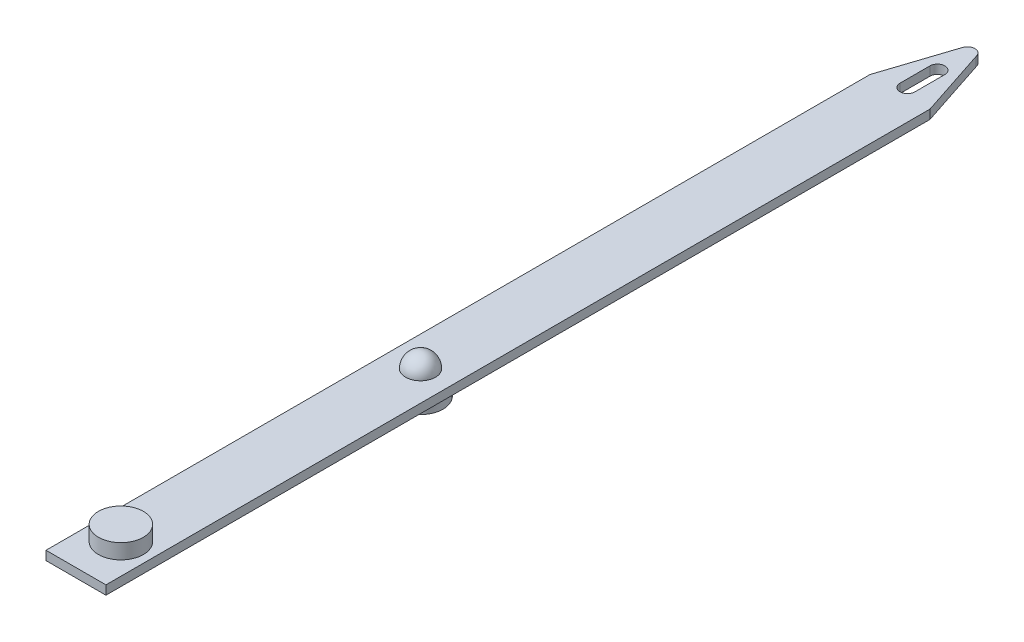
ISO-10303-21;
HEADER;
FILE_DESCRIPTION(('STEP AP214'),'2;1');
FILE_NAME('part.step','',(''),(''),'','','');
FILE_SCHEMA(('AUTOMOTIVE_DESIGN { 1 0 10303 214 1 1 1 1 }'));
ENDSEC;
DATA;
#1=APPLICATION_CONTEXT('core data for automotive mechanical design processes');
#2=APPLICATION_PROTOCOL_DEFINITION('international standard','automotive_design',2000,#1);
#3=PRODUCT_CONTEXT('',#1,'mechanical');
#4=PRODUCT('Part','Part','',(#3));
#5=PRODUCT_RELATED_PRODUCT_CATEGORY('part','',(#4));
#6=PRODUCT_DEFINITION_FORMATION('','',#4);
#7=PRODUCT_DEFINITION_CONTEXT('part definition',#1,'design');
#8=PRODUCT_DEFINITION('design','',#6,#7);
#9=PRODUCT_DEFINITION_SHAPE('','',#8);
#10=(LENGTH_UNIT() NAMED_UNIT(*) SI_UNIT(.MILLI.,.METRE.));
#11=(NAMED_UNIT(*) PLANE_ANGLE_UNIT() SI_UNIT($,.RADIAN.));
#12=(NAMED_UNIT(*) SI_UNIT($,.STERADIAN.) SOLID_ANGLE_UNIT());
#13=UNCERTAINTY_MEASURE_WITH_UNIT(LENGTH_MEASURE(1.E-05),#10,'distance_accuracy_value','');
#14=(GEOMETRIC_REPRESENTATION_CONTEXT(3) GLOBAL_UNCERTAINTY_ASSIGNED_CONTEXT((#13)) GLOBAL_UNIT_ASSIGNED_CONTEXT((#10,
#11,#12)) REPRESENTATION_CONTEXT('',''));
#15=CARTESIAN_POINT('',(0.,0.,0.));
#16=DIRECTION('',(0.,0.,1.));
#17=DIRECTION('',(1.,0.,0.));
#18=AXIS2_PLACEMENT_3D('',#15,#16,#17);
#19=CARTESIAN_POINT('',(0.,0.,-20.));
#20=DIRECTION('',(0.,-1.,0.));
#21=DIRECTION('',(0.,0.,-1.));
#22=AXIS2_PLACEMENT_3D('',#19,#20,#21);
#23=PLANE('',#22);
#24=CARTESIAN_POINT('',(2.,0.,37.));
#25=DIRECTION('',(0.,-1.,0.));
#26=DIRECTION('',(0.,0.,-1.));
#27=AXIS2_PLACEMENT_3D('',#24,#25,#26);
#28=CIRCLE('',#27,1.);
#29=CARTESIAN_POINT('',(2.,0.,36.));
#30=VERTEX_POINT('',#29);
#31=EDGE_CURVE('E449',#30,#30,#28,.T.);
#32=ORIENTED_EDGE('',*,*,#31,.F.);
#33=EDGE_LOOP('',(#32));
#34=FACE_BOUND('',#33,.T.);
#35=CARTESIAN_POINT('',(2.,0.,-17.5));
#36=DIRECTION('',(0.,1.,0.));
#37=DIRECTION('',(0.,0.,1.));
#38=AXIS2_PLACEMENT_3D('',#35,#36,#37);
#39=CIRCLE('',#38,0.5);
#40=CARTESIAN_POINT('',(2.5,0.,-17.5));
#41=VERTEX_POINT('',#40);
#42=CARTESIAN_POINT('',(1.5,0.,-17.5));
#43=VERTEX_POINT('',#42);
#44=EDGE_CURVE('E216',#41,#43,#39,.T.);
#45=ORIENTED_EDGE('',*,*,#44,.T.);
#46=DIRECTION('',(0.,0.,-1.));
#47=VECTOR('',#46,1.);
#48=CARTESIAN_POINT('',(1.5,0.,0.));
#49=LINE('',#48,#47);
#50=CARTESIAN_POINT('',(1.5,0.,-15.5));
#51=VERTEX_POINT('',#50);
#52=EDGE_CURVE('E219',#51,#43,#49,.T.);
#53=ORIENTED_EDGE('',*,*,#52,.F.);
#54=CARTESIAN_POINT('',(2.,0.,-15.5));
#55=DIRECTION('',(0.,1.,0.));
#56=DIRECTION('',(0.,0.,1.));
#57=AXIS2_PLACEMENT_3D('',#54,#55,#56);
#58=CIRCLE('',#57,0.5);
#59=CARTESIAN_POINT('',(2.5,0.,-15.5));
#60=VERTEX_POINT('',#59);
#61=EDGE_CURVE('E128',#51,#60,#58,.T.);
#62=ORIENTED_EDGE('',*,*,#61,.T.);
#63=DIRECTION('',(0.,0.,-1.));
#64=VECTOR('',#63,1.);
#65=CARTESIAN_POINT('',(2.5,0.,0.));
#66=LINE('',#65,#64);
#67=EDGE_CURVE('E223',#60,#41,#66,.T.);
#68=ORIENTED_EDGE('',*,*,#67,.T.);
#69=EDGE_LOOP('',(#45,#53,#62,#68));
#70=FACE_BOUND('',#69,.T.);
#71=DIRECTION('',(0.311256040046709,0.,-0.950326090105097));
#72=VECTOR('',#71,1.);
#73=CARTESIAN_POINT('',(-7.28610313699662,0.,7.24591016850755));
#74=LINE('',#73,#72);
#75=CARTESIAN_POINT('',(0.,0.,-15.));
#76=VERTEX_POINT('',#75);
#77=CARTESIAN_POINT('',(1.52483695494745,0.,-19.6556280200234));
#78=VERTEX_POINT('',#77);
#79=EDGE_CURVE('E238',#76,#78,#74,.T.);
#80=ORIENTED_EDGE('',*,*,#79,.T.);
#81=CARTESIAN_POINT('',(2.,0.,-19.5));
#82=DIRECTION('',(0.,1.,0.));
#83=DIRECTION('',(0.,0.,1.));
#84=AXIS2_PLACEMENT_3D('',#81,#82,#83);
#85=CIRCLE('',#84,0.5);
#86=CARTESIAN_POINT('',(2.4903123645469,0.,-19.5979478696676));
#87=VERTEX_POINT('',#86);
#88=EDGE_CURVE('E253',#87,#78,#85,.T.);
#89=ORIENTED_EDGE('',*,*,#88,.F.);
#90=DIRECTION('',(-0.311954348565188,0.,-0.95009709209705));
#91=VECTOR('',#90,1.);
#92=CARTESIAN_POINT('',(5.1945609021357,0.,-11.3618111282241));
#93=LINE('',#92,#91);
#94=CARTESIAN_POINT('',(4.,0.,-15.));
#95=VERTEX_POINT('',#94);
#96=EDGE_CURVE('E255',#95,#87,#93,.T.);
#97=ORIENTED_EDGE('',*,*,#96,.F.);
#98=DIRECTION('',(0.,0.,1.));
#99=VECTOR('',#98,1.);
#100=CARTESIAN_POINT('',(4.,0.,-20.));
#101=LINE('',#100,#99);
#102=CARTESIAN_POINT('',(4.,0.,40.));
#103=VERTEX_POINT('',#102);
#104=EDGE_CURVE('E191',#95,#103,#101,.T.);
#105=ORIENTED_EDGE('',*,*,#104,.T.);
#106=DIRECTION('',(1.,0.,0.));
#107=VECTOR('',#106,1.);
#108=CARTESIAN_POINT('',(0.,0.,40.));
#109=LINE('',#108,#107);
#110=CARTESIAN_POINT('',(0.,0.,40.));
#111=VERTEX_POINT('',#110);
#112=EDGE_CURVE('E194',#111,#103,#109,.T.);
#113=ORIENTED_EDGE('',*,*,#112,.F.);
#114=DIRECTION('',(0.,0.,1.));
#115=VECTOR('',#114,1.);
#116=CARTESIAN_POINT('',(0.,0.,-20.));
#117=LINE('',#116,#115);
#118=EDGE_CURVE('E107',#76,#111,#117,.T.);
#119=ORIENTED_EDGE('',*,*,#118,.F.);
#120=EDGE_LOOP('',(#80,#89,#97,#105,#113,#119));
#121=FACE_BOUND('',#120,.T.);
#122=CARTESIAN_POINT('',(2.,0.,17.));
#123=DIRECTION('',(0.,-1.,0.));
#124=DIRECTION('',(0.,0.,-1.));
#125=AXIS2_PLACEMENT_3D('',#122,#123,#124);
#126=CIRCLE('',#125,1.5);
#127=CARTESIAN_POINT('',(2.,0.,15.5));
#128=VERTEX_POINT('',#127);
#129=EDGE_CURVE('E447',#128,#128,#126,.T.);
#130=ORIENTED_EDGE('',*,*,#129,.F.);
#131=EDGE_LOOP('',(#130));
#132=FACE_BOUND('',#131,.T.);
#133=ADVANCED_FACE('F103',(#34,#70,#121,#132),#23,.T.);
#134=CARTESIAN_POINT('',(0.,0.6,-20.));
#135=DIRECTION('',(0.,1.,0.));
#136=DIRECTION('',(0.,0.,1.));
#137=AXIS2_PLACEMENT_3D('',#134,#135,#136);
#138=PLANE('',#137);
#139=CARTESIAN_POINT('',(2.,0.6,17.));
#140=DIRECTION('',(0.,1.,0.));
#141=DIRECTION('',(0.,0.,1.));
#142=AXIS2_PLACEMENT_3D('',#139,#140,#141);
#143=CIRCLE('',#142,1.);
#144=CARTESIAN_POINT('',(2.,0.6,18.));
#145=VERTEX_POINT('',#144);
#146=EDGE_CURVE('E207',#145,#145,#143,.T.);
#147=ORIENTED_EDGE('',*,*,#146,.F.);
#148=EDGE_LOOP('',(#147));
#149=FACE_BOUND('',#148,.T.);
#150=CARTESIAN_POINT('',(2.,0.6,-17.5));
#151=DIRECTION('',(0.,1.,0.));
#152=DIRECTION('',(0.,0.,1.));
#153=AXIS2_PLACEMENT_3D('',#150,#151,#152);
#154=CIRCLE('',#153,0.5);
#155=CARTESIAN_POINT('',(2.5,0.6,-17.5));
#156=VERTEX_POINT('',#155);
#157=CARTESIAN_POINT('',(1.5,0.6,-17.5));
#158=VERTEX_POINT('',#157);
#159=EDGE_CURVE('E120',#156,#158,#154,.T.);
#160=ORIENTED_EDGE('',*,*,#159,.F.);
#161=DIRECTION('',(0.,0.,-1.));
#162=VECTOR('',#161,1.);
#163=CARTESIAN_POINT('',(2.5,0.6,0.));
#164=LINE('',#163,#162);
#165=CARTESIAN_POINT('',(2.5,0.6,-15.5));
#166=VERTEX_POINT('',#165);
#167=EDGE_CURVE('E220',#166,#156,#164,.T.);
#168=ORIENTED_EDGE('',*,*,#167,.F.);
#169=CARTESIAN_POINT('',(2.,0.6,-15.5));
#170=DIRECTION('',(0.,1.,0.));
#171=DIRECTION('',(0.,0.,1.));
#172=AXIS2_PLACEMENT_3D('',#169,#170,#171);
#173=CIRCLE('',#172,0.5);
#174=CARTESIAN_POINT('',(1.5,0.6,-15.5));
#175=VERTEX_POINT('',#174);
#176=EDGE_CURVE('E231',#175,#166,#173,.T.);
#177=ORIENTED_EDGE('',*,*,#176,.F.);
#178=DIRECTION('',(0.,0.,-1.));
#179=VECTOR('',#178,1.);
#180=CARTESIAN_POINT('',(1.5,0.6,0.));
#181=LINE('',#180,#179);
#182=EDGE_CURVE('E228',#175,#158,#181,.T.);
#183=ORIENTED_EDGE('',*,*,#182,.T.);
#184=EDGE_LOOP('',(#160,#168,#177,#183));
#185=FACE_BOUND('',#184,.T.);
#186=CARTESIAN_POINT('',(2.,0.6,-19.5));
#187=DIRECTION('',(0.,1.,0.));
#188=DIRECTION('',(0.,0.,1.));
#189=AXIS2_PLACEMENT_3D('',#186,#187,#188);
#190=CIRCLE('',#189,0.5);
#191=CARTESIAN_POINT('',(2.4903123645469,0.6,-19.5979478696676));
#192=VERTEX_POINT('',#191);
#193=CARTESIAN_POINT('',(1.52483695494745,0.6,-19.6556280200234));
#194=VERTEX_POINT('',#193);
#195=EDGE_CURVE('E251',#192,#194,#190,.T.);
#196=ORIENTED_EDGE('',*,*,#195,.T.);
#197=DIRECTION('',(0.311256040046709,0.,-0.950326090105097));
#198=VECTOR('',#197,1.);
#199=CARTESIAN_POINT('',(-7.28610313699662,0.6,7.24591016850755));
#200=LINE('',#199,#198);
#201=CARTESIAN_POINT('',(0.,0.6,-15.));
#202=VERTEX_POINT('',#201);
#203=EDGE_CURVE('E245',#202,#194,#200,.T.);
#204=ORIENTED_EDGE('',*,*,#203,.F.);
#205=DIRECTION('',(0.,0.,1.));
#206=VECTOR('',#205,1.);
#207=CARTESIAN_POINT('',(0.,0.6,-20.));
#208=LINE('',#207,#206);
#209=CARTESIAN_POINT('',(0.,0.6,40.));
#210=VERTEX_POINT('',#209);
#211=EDGE_CURVE('E12',#202,#210,#208,.T.);
#212=ORIENTED_EDGE('',*,*,#211,.T.);
#213=DIRECTION('',(-1.,0.,0.));
#214=VECTOR('',#213,1.);
#215=CARTESIAN_POINT('',(0.,0.6,40.));
#216=LINE('',#215,#214);
#217=CARTESIAN_POINT('',(4.,0.6,40.));
#218=VERTEX_POINT('',#217);
#219=EDGE_CURVE('E206',#218,#210,#216,.T.);
#220=ORIENTED_EDGE('',*,*,#219,.F.);
#221=DIRECTION('',(0.,0.,1.));
#222=VECTOR('',#221,1.);
#223=CARTESIAN_POINT('',(4.,0.6,-20.));
#224=LINE('',#223,#222);
#225=CARTESIAN_POINT('',(4.,0.6,-15.));
#226=VERTEX_POINT('',#225);
#227=EDGE_CURVE('E112',#226,#218,#224,.T.);
#228=ORIENTED_EDGE('',*,*,#227,.F.);
#229=DIRECTION('',(-0.311954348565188,0.,-0.95009709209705));
#230=VECTOR('',#229,1.);
#231=CARTESIAN_POINT('',(5.1945609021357,0.6,-11.3618111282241));
#232=LINE('',#231,#230);
#233=EDGE_CURVE('E256',#226,#192,#232,.T.);
#234=ORIENTED_EDGE('',*,*,#233,.T.);
#235=EDGE_LOOP('',(#196,#204,#212,#220,#228,#234));
#236=FACE_BOUND('',#235,.T.);
#237=CARTESIAN_POINT('',(2.,0.6,37.));
#238=DIRECTION('',(0.,1.,0.));
#239=DIRECTION('',(0.,0.,1.));
#240=AXIS2_PLACEMENT_3D('',#237,#238,#239);
#241=CIRCLE('',#240,1.5);
#242=CARTESIAN_POINT('',(2.,0.6,38.5));
#243=VERTEX_POINT('',#242);
#244=EDGE_CURVE('E454',#243,#243,#241,.T.);
#245=ORIENTED_EDGE('',*,*,#244,.F.);
#246=EDGE_LOOP('',(#245));
#247=FACE_BOUND('',#246,.T.);
#248=ADVANCED_FACE('F269',(#149,#185,#236,#247),#138,.T.);
#249=CARTESIAN_POINT('',(4.,0.,-20.));
#250=DIRECTION('',(1.,0.,0.));
#251=DIRECTION('',(0.,0.,-1.));
#252=AXIS2_PLACEMENT_3D('',#249,#250,#251);
#253=PLANE('',#252);
#254=ORIENTED_EDGE('',*,*,#104,.F.);
#255=DIRECTION('',(0.,1.,0.));
#256=VECTOR('',#255,1.);
#257=CARTESIAN_POINT('',(4.,0.,-15.));
#258=LINE('',#257,#256);
#259=EDGE_CURVE('E192',#95,#226,#258,.T.);
#260=ORIENTED_EDGE('',*,*,#259,.T.);
#261=ORIENTED_EDGE('',*,*,#227,.T.);
#262=DIRECTION('',(0.,1.,0.));
#263=VECTOR('',#262,1.);
#264=CARTESIAN_POINT('',(4.,0.6,40.));
#265=LINE('',#264,#263);
#266=EDGE_CURVE('E201',#103,#218,#265,.T.);
#267=ORIENTED_EDGE('',*,*,#266,.F.);
#268=EDGE_LOOP('',(#254,#260,#261,#267));
#269=FACE_BOUND('',#268,.T.);
#270=ADVANCED_FACE('F267',(#269),#253,.T.);
#271=CARTESIAN_POINT('',(0.,0.,-20.));
#272=DIRECTION('',(-1.,0.,0.));
#273=DIRECTION('',(0.,0.,1.));
#274=AXIS2_PLACEMENT_3D('',#271,#272,#273);
#275=PLANE('',#274);
#276=DIRECTION('',(0.,1.,0.));
#277=VECTOR('',#276,1.);
#278=CARTESIAN_POINT('',(0.,0.,-15.));
#279=LINE('',#278,#277);
#280=EDGE_CURVE('E188',#76,#202,#279,.T.);
#281=ORIENTED_EDGE('',*,*,#280,.F.);
#282=ORIENTED_EDGE('',*,*,#118,.T.);
#283=DIRECTION('',(0.,-1.,0.));
#284=VECTOR('',#283,1.);
#285=CARTESIAN_POINT('',(0.,0.6,40.));
#286=LINE('',#285,#284);
#287=EDGE_CURVE('E187',#210,#111,#286,.T.);
#288=ORIENTED_EDGE('',*,*,#287,.F.);
#289=ORIENTED_EDGE('',*,*,#211,.F.);
#290=EDGE_LOOP('',(#281,#282,#288,#289));
#291=FACE_BOUND('',#290,.T.);
#292=ADVANCED_FACE('F184',(#291),#275,.T.);
#293=CARTESIAN_POINT('',(2.,0.,-19.5));
#294=DIRECTION('',(0.,1.,0.));
#295=DIRECTION('',(0.,0.,1.));
#296=AXIS2_PLACEMENT_3D('',#293,#294,#295);
#297=CYLINDRICAL_SURFACE('',#296,0.5);
#298=ORIENTED_EDGE('',*,*,#195,.F.);
#299=DIRECTION('',(0.,1.,0.));
#300=VECTOR('',#299,1.);
#301=CARTESIAN_POINT('',(2.4903123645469,0.,-19.5979478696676));
#302=LINE('',#301,#300);
#303=EDGE_CURVE('E258',#87,#192,#302,.T.);
#304=ORIENTED_EDGE('',*,*,#303,.F.);
#305=ORIENTED_EDGE('',*,*,#88,.T.);
#306=DIRECTION('',(0.,1.,0.));
#307=VECTOR('',#306,1.);
#308=CARTESIAN_POINT('',(1.52483695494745,0.,-19.6556280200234));
#309=LINE('',#308,#307);
#310=EDGE_CURVE('E246',#78,#194,#309,.T.);
#311=ORIENTED_EDGE('',*,*,#310,.T.);
#312=EDGE_LOOP('',(#298,#304,#305,#311));
#313=FACE_BOUND('',#312,.T.);
#314=ADVANCED_FACE('F279',(#313),#297,.T.);
#315=CARTESIAN_POINT('',(5.1945609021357,0.,-11.3618111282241));
#316=DIRECTION('',(0.95009709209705,0.,-0.311954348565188));
#317=DIRECTION('',(-0.311954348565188,0.,-0.95009709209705));
#318=AXIS2_PLACEMENT_3D('',#315,#316,#317);
#319=PLANE('',#318);
#320=ORIENTED_EDGE('',*,*,#233,.F.);
#321=ORIENTED_EDGE('',*,*,#259,.F.);
#322=ORIENTED_EDGE('',*,*,#96,.T.);
#323=ORIENTED_EDGE('',*,*,#303,.T.);
#324=EDGE_LOOP('',(#320,#321,#322,#323));
#325=FACE_BOUND('',#324,.T.);
#326=ADVANCED_FACE('F281',(#325),#319,.T.);
#327=CARTESIAN_POINT('',(-7.28610313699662,0.,7.24591016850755));
#328=DIRECTION('',(0.950326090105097,0.,0.311256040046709));
#329=DIRECTION('',(0.311256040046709,0.,-0.950326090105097));
#330=AXIS2_PLACEMENT_3D('',#327,#328,#329);
#331=PLANE('',#330);
#332=ORIENTED_EDGE('',*,*,#203,.T.);
#333=ORIENTED_EDGE('',*,*,#310,.F.);
#334=ORIENTED_EDGE('',*,*,#79,.F.);
#335=ORIENTED_EDGE('',*,*,#280,.T.);
#336=EDGE_LOOP('',(#332,#333,#334,#335));
#337=FACE_BOUND('',#336,.T.);
#338=ADVANCED_FACE('F275',(#337),#331,.F.);
#339=CARTESIAN_POINT('',(2.,0.,-17.5));
#340=DIRECTION('',(0.,1.,0.));
#341=DIRECTION('',(0.,0.,1.));
#342=AXIS2_PLACEMENT_3D('',#339,#340,#341);
#343=CYLINDRICAL_SURFACE('',#342,0.5);
#344=ORIENTED_EDGE('',*,*,#159,.T.);
#345=DIRECTION('',(0.,1.,0.));
#346=VECTOR('',#345,1.);
#347=CARTESIAN_POINT('',(1.5,0.,-17.5));
#348=LINE('',#347,#346);
#349=EDGE_CURVE('E226',#43,#158,#348,.T.);
#350=ORIENTED_EDGE('',*,*,#349,.F.);
#351=ORIENTED_EDGE('',*,*,#44,.F.);
#352=DIRECTION('',(0.,1.,0.));
#353=VECTOR('',#352,1.);
#354=CARTESIAN_POINT('',(2.5,0.,-17.5));
#355=LINE('',#354,#353);
#356=EDGE_CURVE('E236',#41,#156,#355,.T.);
#357=ORIENTED_EDGE('',*,*,#356,.T.);
#358=EDGE_LOOP('',(#344,#350,#351,#357));
#359=FACE_BOUND('',#358,.T.);
#360=ADVANCED_FACE('F288',(#359),#343,.F.);
#361=CARTESIAN_POINT('',(2.5,0.,0.));
#362=DIRECTION('',(1.,0.,0.));
#363=DIRECTION('',(0.,0.,-1.));
#364=AXIS2_PLACEMENT_3D('',#361,#362,#363);
#365=PLANE('',#364);
#366=ORIENTED_EDGE('',*,*,#167,.T.);
#367=ORIENTED_EDGE('',*,*,#356,.F.);
#368=ORIENTED_EDGE('',*,*,#67,.F.);
#369=DIRECTION('',(0.,1.,0.));
#370=VECTOR('',#369,1.);
#371=CARTESIAN_POINT('',(2.5,0.,-15.5));
#372=LINE('',#371,#370);
#373=EDGE_CURVE('E239',#60,#166,#372,.T.);
#374=ORIENTED_EDGE('',*,*,#373,.T.);
#375=EDGE_LOOP('',(#366,#367,#368,#374));
#376=FACE_BOUND('',#375,.T.);
#377=ADVANCED_FACE('F327',(#376),#365,.F.);
#378=CARTESIAN_POINT('',(2.,0.,-15.5));
#379=DIRECTION('',(0.,1.,0.));
#380=DIRECTION('',(0.,0.,1.));
#381=AXIS2_PLACEMENT_3D('',#378,#379,#380);
#382=CYLINDRICAL_SURFACE('',#381,0.5);
#383=ORIENTED_EDGE('',*,*,#176,.T.);
#384=ORIENTED_EDGE('',*,*,#373,.F.);
#385=ORIENTED_EDGE('',*,*,#61,.F.);
#386=DIRECTION('',(0.,1.,0.));
#387=VECTOR('',#386,1.);
#388=CARTESIAN_POINT('',(1.5,0.,-15.5));
#389=LINE('',#388,#387);
#390=EDGE_CURVE('E241',#51,#175,#389,.T.);
#391=ORIENTED_EDGE('',*,*,#390,.T.);
#392=EDGE_LOOP('',(#383,#384,#385,#391));
#393=FACE_BOUND('',#392,.T.);
#394=ADVANCED_FACE('F328',(#393),#382,.F.);
#395=CARTESIAN_POINT('',(1.5,0.,0.));
#396=DIRECTION('',(1.,0.,0.));
#397=DIRECTION('',(0.,0.,-1.));
#398=AXIS2_PLACEMENT_3D('',#395,#396,#397);
#399=PLANE('',#398);
#400=ORIENTED_EDGE('',*,*,#182,.F.);
#401=ORIENTED_EDGE('',*,*,#390,.F.);
#402=ORIENTED_EDGE('',*,*,#52,.T.);
#403=ORIENTED_EDGE('',*,*,#349,.T.);
#404=EDGE_LOOP('',(#400,#401,#402,#403));
#405=FACE_BOUND('',#404,.T.);
#406=ADVANCED_FACE('F322',(#405),#399,.T.);
#407=CARTESIAN_POINT('',(0.,0.,40.));
#408=DIRECTION('',(0.,0.,1.));
#409=DIRECTION('',(1.,0.,0.));
#410=AXIS2_PLACEMENT_3D('',#407,#408,#409);
#411=PLANE('',#410);
#412=ORIENTED_EDGE('',*,*,#287,.T.);
#413=ORIENTED_EDGE('',*,*,#112,.T.);
#414=ORIENTED_EDGE('',*,*,#266,.T.);
#415=ORIENTED_EDGE('',*,*,#219,.T.);
#416=EDGE_LOOP('',(#412,#413,#414,#415));
#417=FACE_BOUND('',#416,.T.);
#418=ADVANCED_FACE('F204',(#417),#411,.T.);
#419=CARTESIAN_POINT('',(2.,1.6,37.));
#420=DIRECTION('',(0.,-1.,0.));
#421=DIRECTION('',(0.,0.,-1.));
#422=AXIS2_PLACEMENT_3D('',#419,#420,#421);
#423=CYLINDRICAL_SURFACE('',#422,1.5);
#424=CARTESIAN_POINT('',(2.,1.6,37.));
#425=DIRECTION('',(0.,1.,0.));
#426=DIRECTION('',(0.,0.,1.));
#427=AXIS2_PLACEMENT_3D('',#424,#425,#426);
#428=CIRCLE('',#427,1.5);
#429=CARTESIAN_POINT('',(2.,1.6,38.5));
#430=VERTEX_POINT('',#429);
#431=EDGE_CURVE('E210',#430,#430,#428,.T.);
#432=ORIENTED_EDGE('',*,*,#431,.F.);
#433=EDGE_LOOP('',(#432));
#434=FACE_BOUND('',#433,.T.);
#435=ORIENTED_EDGE('',*,*,#244,.T.);
#436=EDGE_LOOP('',(#435));
#437=FACE_BOUND('',#436,.T.);
#438=ADVANCED_FACE('F382',(#434,#437),#423,.T.);
#439=CARTESIAN_POINT('',(2.,1.6,37.));
#440=DIRECTION('',(0.,1.,0.));
#441=DIRECTION('',(0.,0.,1.));
#442=AXIS2_PLACEMENT_3D('',#439,#440,#441);
#443=PLANE('',#442);
#444=ORIENTED_EDGE('',*,*,#431,.T.);
#445=EDGE_LOOP('',(#444));
#446=FACE_BOUND('',#445,.T.);
#447=ADVANCED_FACE('F397',(#446),#443,.T.);
#448=CARTESIAN_POINT('',(2.,-1.,17.));
#449=DIRECTION('',(0.,1.,0.));
#450=DIRECTION('',(0.,0.,1.));
#451=AXIS2_PLACEMENT_3D('',#448,#449,#450);
#452=CYLINDRICAL_SURFACE('',#451,1.5);
#453=CARTESIAN_POINT('',(2.,-1.,17.));
#454=DIRECTION('',(0.,-1.,0.));
#455=DIRECTION('',(0.,0.,-1.));
#456=AXIS2_PLACEMENT_3D('',#453,#454,#455);
#457=CIRCLE('',#456,1.5);
#458=CARTESIAN_POINT('',(2.,-1.,15.5));
#459=VERTEX_POINT('',#458);
#460=EDGE_CURVE('E444',#459,#459,#457,.T.);
#461=ORIENTED_EDGE('',*,*,#460,.F.);
#462=EDGE_LOOP('',(#461));
#463=FACE_BOUND('',#462,.T.);
#464=ORIENTED_EDGE('',*,*,#129,.T.);
#465=EDGE_LOOP('',(#464));
#466=FACE_BOUND('',#465,.T.);
#467=ADVANCED_FACE('F313',(#463,#466),#452,.T.);
#468=CARTESIAN_POINT('',(2.,-1.,17.));
#469=DIRECTION('',(0.,-1.,0.));
#470=DIRECTION('',(0.,0.,-1.));
#471=AXIS2_PLACEMENT_3D('',#468,#469,#470);
#472=PLANE('',#471);
#473=ORIENTED_EDGE('',*,*,#460,.T.);
#474=EDGE_LOOP('',(#473));
#475=FACE_BOUND('',#474,.T.);
#476=ADVANCED_FACE('F306',(#475),#472,.T.);
#477=CARTESIAN_POINT('',(2.,0.6,17.));
#478=DIRECTION('',(0.,0.,1.));
#479=DIRECTION('',(1.,0.,0.));
#480=AXIS2_PLACEMENT_3D('',#477,#478,#479);
#481=SPHERICAL_SURFACE('',#480,1.);
#482=CARTESIAN_POINT('',(2.,0.6,17.));
#483=DIRECTION('',(0.,1.,0.));
#484=DIRECTION('',(0.,0.,1.));
#485=AXIS2_PLACEMENT_3D('',#482,#483,#484);
#486=SPHERICAL_SURFACE('',#485,1.);
#487=ORIENTED_EDGE('',*,*,#146,.T.);
#488=EDGE_LOOP('',(#487));
#489=FACE_BOUND('',#488,.T.);
#490=ADVANCED_FACE('F304',(#489),#486,.T.);
#491=CARTESIAN_POINT('',(2.,0.,37.));
#492=DIRECTION('',(0.,0.,1.));
#493=DIRECTION('',(1.,0.,0.));
#494=AXIS2_PLACEMENT_3D('',#491,#492,#493);
#495=SPHERICAL_SURFACE('',#494,1.);
#496=CARTESIAN_POINT('',(2.,0.,37.));
#497=DIRECTION('',(0.,-1.,0.));
#498=DIRECTION('',(0.,0.,-1.));
#499=AXIS2_PLACEMENT_3D('',#496,#497,#498);
#500=SPHERICAL_SURFACE('',#499,1.);
#501=ORIENTED_EDGE('',*,*,#31,.T.);
#502=EDGE_LOOP('',(#501));
#503=FACE_BOUND('',#502,.T.);
#504=ADVANCED_FACE('F105',(#503),#500,.T.);
#505=CLOSED_SHELL('',(#133,#248,#270,#292,#314,#326,#338,#360,#377,#394,#406,#418,#438,#447,
#467,#476,#490,#504));
#506=MANIFOLD_SOLID_BREP('B2',#505);
#507=ADVANCED_BREP_SHAPE_REPRESENTATION('',(#18,#506),#14);
#508=SHAPE_DEFINITION_REPRESENTATION(#9,#507);
ENDSEC;
END-ISO-10303-21;
